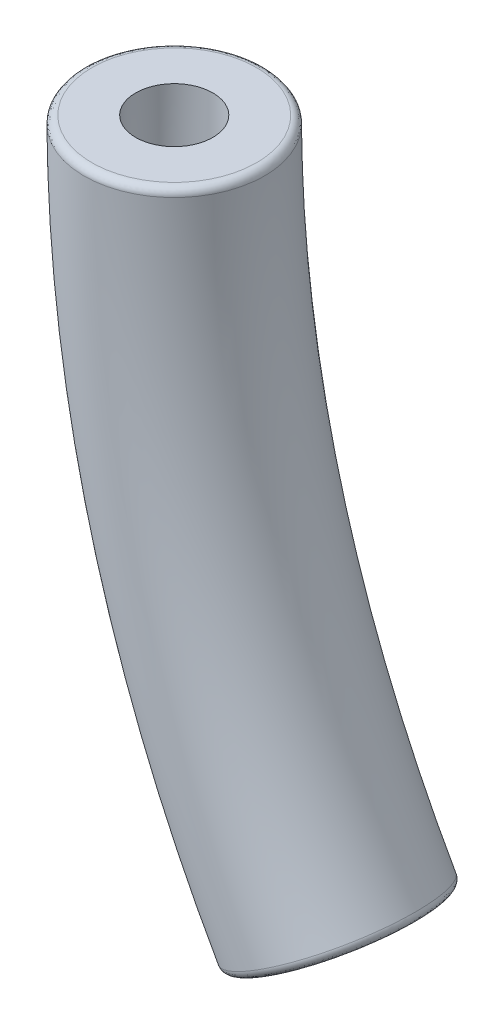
from build123d import *

# Parameters (mm, degrees)
ESQUISSE3_R   = 35
ESQUISSE3_R_2 = 15
CONG_1_R      = 3


with BuildPart() as part:
    # Balayage1: sweep along a path in Esquisse2
    with BuildLine(Plane.XY) as balayage1_path:
        ThreePointArc((-482, 0), (-465.509398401, -125), (-417.165975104, -241.446783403))
    # Esquisse3 → Balayage1 (sweep)
    with BuildSketch(Plane(origin=(-482, 0, 0), x_dir=(1, 0, 0), z_dir=(0, -1, 0))):
        Circle(ESQUISSE3_R)
        Circle(ESQUISSE3_R_2, mode=Mode.SUBTRACT)
    sweep(path=balayage1_path.line)

    # Cong_1
    cong_1_edges = [part.edges().sort_by_distance(p)[0] for p in [
        (-517, 0, 0),
        (-447.458110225, -258.979226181, 0),
    ]]
    fillet(cong_1_edges, radius=CONG_1_R)


solid = part.part
